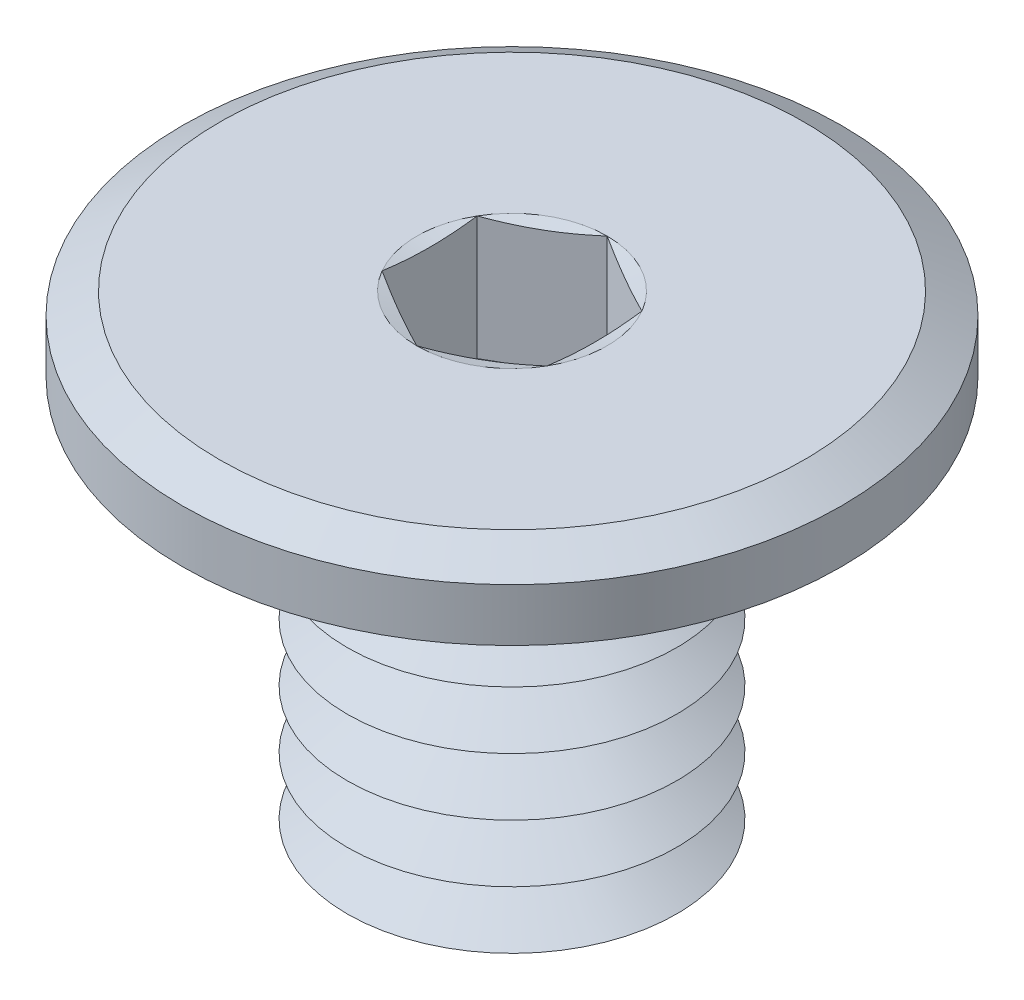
ISO-10303-21;
HEADER;
FILE_DESCRIPTION(('STEP AP214'),'2;1');
FILE_NAME('part.step','',(''),(''),'','','');
FILE_SCHEMA(('AUTOMOTIVE_DESIGN { 1 0 10303 214 1 1 1 1 }'));
ENDSEC;
DATA;
#1=APPLICATION_CONTEXT('core data for automotive mechanical design processes');
#2=APPLICATION_PROTOCOL_DEFINITION('international standard','automotive_design',2000,#1);
#3=PRODUCT_CONTEXT('',#1,'mechanical');
#4=PRODUCT('Part','Part','',(#3));
#5=PRODUCT_RELATED_PRODUCT_CATEGORY('part','',(#4));
#6=PRODUCT_DEFINITION_FORMATION('','',#4);
#7=PRODUCT_DEFINITION_CONTEXT('part definition',#1,'design');
#8=PRODUCT_DEFINITION('design','',#6,#7);
#9=PRODUCT_DEFINITION_SHAPE('','',#8);
#10=(LENGTH_UNIT() NAMED_UNIT(*) SI_UNIT(.MILLI.,.METRE.));
#11=(NAMED_UNIT(*) PLANE_ANGLE_UNIT() SI_UNIT($,.RADIAN.));
#12=(NAMED_UNIT(*) SI_UNIT($,.STERADIAN.) SOLID_ANGLE_UNIT());
#13=UNCERTAINTY_MEASURE_WITH_UNIT(LENGTH_MEASURE(1.E-05),#10,'distance_accuracy_value','');
#14=(GEOMETRIC_REPRESENTATION_CONTEXT(3) GLOBAL_UNCERTAINTY_ASSIGNED_CONTEXT((#13)) GLOBAL_UNIT_ASSIGNED_CONTEXT((#10,
#11,#12)) REPRESENTATION_CONTEXT('',''));
#15=CARTESIAN_POINT('',(0.,0.,0.));
#16=DIRECTION('',(0.,0.,1.));
#17=DIRECTION('',(1.,0.,0.));
#18=AXIS2_PLACEMENT_3D('',#15,#16,#17);
#19=CARTESIAN_POINT('',(0.,-4.85,0.));
#20=DIRECTION('',(0.,-1.,0.));
#21=DIRECTION('',(0.,0.,-1.));
#22=AXIS2_PLACEMENT_3D('',#19,#20,#21);
#23=CONICAL_SURFACE('',#22,2.,1.0471975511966);
#24=CARTESIAN_POINT('',(0.,-4.5,0.));
#25=DIRECTION('',(0.,1.,0.));
#26=DIRECTION('',(0.,0.,1.));
#27=AXIS2_PLACEMENT_3D('',#24,#25,#26);
#28=CIRCLE('',#27,1.39378221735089);
#29=CARTESIAN_POINT('',(0.,-4.5,1.39378221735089));
#30=VERTEX_POINT('',#29);
#31=EDGE_CURVE('E401',#30,#30,#28,.T.);
#32=ORIENTED_EDGE('',*,*,#31,.F.);
#33=EDGE_LOOP('',(#32));
#34=FACE_BOUND('',#33,.T.);
#35=CARTESIAN_POINT('',(0.,-4.85,0.));
#36=DIRECTION('',(0.,1.,0.));
#37=DIRECTION('',(0.,0.,1.));
#38=AXIS2_PLACEMENT_3D('',#35,#36,#37);
#39=CIRCLE('',#38,2.);
#40=CARTESIAN_POINT('',(0.,-4.85,2.));
#41=VERTEX_POINT('',#40);
#42=EDGE_CURVE('E405',#41,#41,#39,.T.);
#43=ORIENTED_EDGE('',*,*,#42,.T.);
#44=EDGE_LOOP('',(#43));
#45=FACE_BOUND('',#44,.T.);
#46=ADVANCED_FACE('F39',(#34,#45),#23,.T.);
#47=CARTESIAN_POINT('',(0.,-4.5,0.));
#48=DIRECTION('',(0.,1.,0.));
#49=DIRECTION('',(0.,0.,1.));
#50=AXIS2_PLACEMENT_3D('',#47,#48,#49);
#51=CONICAL_SURFACE('',#50,1.39378221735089,1.0471975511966);
#52=CARTESIAN_POINT('',(0.,-4.15,0.));
#53=DIRECTION('',(0.,1.,0.));
#54=DIRECTION('',(0.,0.,1.));
#55=AXIS2_PLACEMENT_3D('',#52,#53,#54);
#56=CIRCLE('',#55,2.);
#57=CARTESIAN_POINT('',(0.,-4.15,2.));
#58=VERTEX_POINT('',#57);
#59=EDGE_CURVE('E398',#58,#58,#56,.T.);
#60=ORIENTED_EDGE('',*,*,#59,.F.);
#61=EDGE_LOOP('',(#60));
#62=FACE_BOUND('',#61,.T.);
#63=ORIENTED_EDGE('',*,*,#31,.T.);
#64=EDGE_LOOP('',(#63));
#65=FACE_BOUND('',#64,.T.);
#66=ADVANCED_FACE('F233',(#62,#65),#51,.T.);
#67=CARTESIAN_POINT('',(0.,-5.9,0.));
#68=DIRECTION('',(0.,-1.,0.));
#69=DIRECTION('',(0.,0.,-1.));
#70=AXIS2_PLACEMENT_3D('',#67,#68,#69);
#71=PLANE('',#70);
#72=CARTESIAN_POINT('',(0.,-5.9,0.));
#73=DIRECTION('',(0.,1.,0.));
#74=DIRECTION('',(0.,0.,1.));
#75=AXIS2_PLACEMENT_3D('',#72,#73,#74);
#76=CIRCLE('',#75,1.39378221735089);
#77=CARTESIAN_POINT('',(0.,-5.9,1.39378221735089));
#78=VERTEX_POINT('',#77);
#79=EDGE_CURVE('E298',#78,#78,#76,.T.);
#80=ORIENTED_EDGE('',*,*,#79,.F.);
#81=EDGE_LOOP('',(#80));
#82=FACE_BOUND('',#81,.T.);
#83=ADVANCED_FACE('F239',(#82),#71,.T.);
#84=CARTESIAN_POINT('',(0.,-5.9,0.));
#85=DIRECTION('',(0.,1.,0.));
#86=DIRECTION('',(0.,0.,1.));
#87=AXIS2_PLACEMENT_3D('',#84,#85,#86);
#88=CONICAL_SURFACE('',#87,1.39378221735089,1.0471975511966);
#89=CARTESIAN_POINT('',(0.,-5.55,0.));
#90=DIRECTION('',(0.,1.,0.));
#91=DIRECTION('',(0.,0.,1.));
#92=AXIS2_PLACEMENT_3D('',#89,#90,#91);
#93=CIRCLE('',#92,2.);
#94=CARTESIAN_POINT('',(0.,-5.55,2.));
#95=VERTEX_POINT('',#94);
#96=EDGE_CURVE('E412',#95,#95,#93,.T.);
#97=ORIENTED_EDGE('',*,*,#96,.F.);
#98=EDGE_LOOP('',(#97));
#99=FACE_BOUND('',#98,.T.);
#100=ORIENTED_EDGE('',*,*,#79,.T.);
#101=EDGE_LOOP('',(#100));
#102=FACE_BOUND('',#101,.T.);
#103=ADVANCED_FACE('F254',(#99,#102),#88,.T.);
#104=CARTESIAN_POINT('',(0.,-5.55,0.));
#105=DIRECTION('',(0.,-1.,0.));
#106=DIRECTION('',(0.,0.,-1.));
#107=AXIS2_PLACEMENT_3D('',#104,#105,#106);
#108=CONICAL_SURFACE('',#107,2.,1.0471975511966);
#109=CARTESIAN_POINT('',(0.,-5.2,0.));
#110=DIRECTION('',(0.,1.,0.));
#111=DIRECTION('',(0.,0.,1.));
#112=AXIS2_PLACEMENT_3D('',#109,#110,#111);
#113=CIRCLE('',#112,1.39378221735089);
#114=CARTESIAN_POINT('',(0.,-5.2,1.39378221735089));
#115=VERTEX_POINT('',#114);
#116=EDGE_CURVE('E408',#115,#115,#113,.T.);
#117=ORIENTED_EDGE('',*,*,#116,.F.);
#118=EDGE_LOOP('',(#117));
#119=FACE_BOUND('',#118,.T.);
#120=ORIENTED_EDGE('',*,*,#96,.T.);
#121=EDGE_LOOP('',(#120));
#122=FACE_BOUND('',#121,.T.);
#123=ADVANCED_FACE('F250',(#119,#122),#108,.T.);
#124=CARTESIAN_POINT('',(0.,-5.2,0.));
#125=DIRECTION('',(0.,1.,0.));
#126=DIRECTION('',(0.,0.,1.));
#127=AXIS2_PLACEMENT_3D('',#124,#125,#126);
#128=CONICAL_SURFACE('',#127,1.39378221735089,1.0471975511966);
#129=ORIENTED_EDGE('',*,*,#42,.F.);
#130=EDGE_LOOP('',(#129));
#131=FACE_BOUND('',#130,.T.);
#132=ORIENTED_EDGE('',*,*,#116,.T.);
#133=EDGE_LOOP('',(#132));
#134=FACE_BOUND('',#133,.T.);
#135=ADVANCED_FACE('F246',(#131,#134),#128,.T.);
#136=CARTESIAN_POINT('',(0.,-4.15,0.));
#137=DIRECTION('',(0.,-1.,0.));
#138=DIRECTION('',(0.,0.,-1.));
#139=AXIS2_PLACEMENT_3D('',#136,#137,#138);
#140=CONICAL_SURFACE('',#139,2.,1.0471975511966);
#141=CARTESIAN_POINT('',(0.,-3.8,0.));
#142=DIRECTION('',(0.,1.,0.));
#143=DIRECTION('',(0.,0.,1.));
#144=AXIS2_PLACEMENT_3D('',#141,#142,#143);
#145=CIRCLE('',#144,1.39378221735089);
#146=CARTESIAN_POINT('',(0.,-3.8,1.39378221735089));
#147=VERTEX_POINT('',#146);
#148=EDGE_CURVE('E394',#147,#147,#145,.T.);
#149=ORIENTED_EDGE('',*,*,#148,.F.);
#150=EDGE_LOOP('',(#149));
#151=FACE_BOUND('',#150,.T.);
#152=ORIENTED_EDGE('',*,*,#59,.T.);
#153=EDGE_LOOP('',(#152));
#154=FACE_BOUND('',#153,.T.);
#155=ADVANCED_FACE('F249',(#151,#154),#140,.T.);
#156=CARTESIAN_POINT('',(0.,-3.8,0.));
#157=DIRECTION('',(0.,1.,0.));
#158=DIRECTION('',(0.,0.,1.));
#159=AXIS2_PLACEMENT_3D('',#156,#157,#158);
#160=CONICAL_SURFACE('',#159,1.39378221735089,1.0471975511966);
#161=CARTESIAN_POINT('',(0.,-3.45,0.));
#162=DIRECTION('',(0.,1.,0.));
#163=DIRECTION('',(0.,0.,1.));
#164=AXIS2_PLACEMENT_3D('',#161,#162,#163);
#165=CIRCLE('',#164,2.);
#166=CARTESIAN_POINT('',(0.,-3.45,2.));
#167=VERTEX_POINT('',#166);
#168=EDGE_CURVE('E390',#167,#167,#165,.T.);
#169=ORIENTED_EDGE('',*,*,#168,.F.);
#170=EDGE_LOOP('',(#169));
#171=FACE_BOUND('',#170,.T.);
#172=ORIENTED_EDGE('',*,*,#148,.T.);
#173=EDGE_LOOP('',(#172));
#174=FACE_BOUND('',#173,.T.);
#175=ADVANCED_FACE('F558',(#171,#174),#160,.T.);
#176=CARTESIAN_POINT('',(0.,-3.45,0.));
#177=DIRECTION('',(0.,-1.,0.));
#178=DIRECTION('',(0.,0.,-1.));
#179=AXIS2_PLACEMENT_3D('',#176,#177,#178);
#180=CONICAL_SURFACE('',#179,2.,1.0471975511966);
#181=CARTESIAN_POINT('',(0.,-3.1,0.));
#182=DIRECTION('',(0.,1.,0.));
#183=DIRECTION('',(0.,0.,1.));
#184=AXIS2_PLACEMENT_3D('',#181,#182,#183);
#185=CIRCLE('',#184,1.39378221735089);
#186=CARTESIAN_POINT('',(0.,-3.1,1.39378221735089));
#187=VERTEX_POINT('',#186);
#188=EDGE_CURVE('E387',#187,#187,#185,.T.);
#189=ORIENTED_EDGE('',*,*,#188,.F.);
#190=EDGE_LOOP('',(#189));
#191=FACE_BOUND('',#190,.T.);
#192=ORIENTED_EDGE('',*,*,#168,.T.);
#193=EDGE_LOOP('',(#192));
#194=FACE_BOUND('',#193,.T.);
#195=ADVANCED_FACE('F549',(#191,#194),#180,.T.);
#196=CARTESIAN_POINT('',(0.,-3.1,0.));
#197=DIRECTION('',(0.,1.,0.));
#198=DIRECTION('',(0.,0.,1.));
#199=AXIS2_PLACEMENT_3D('',#196,#197,#198);
#200=CONICAL_SURFACE('',#199,1.39378221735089,1.0471975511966);
#201=CARTESIAN_POINT('',(0.,-2.75,0.));
#202=DIRECTION('',(0.,1.,0.));
#203=DIRECTION('',(0.,0.,1.));
#204=AXIS2_PLACEMENT_3D('',#201,#202,#203);
#205=CIRCLE('',#204,2.);
#206=CARTESIAN_POINT('',(0.,-2.75,2.));
#207=VERTEX_POINT('',#206);
#208=EDGE_CURVE('E384',#207,#207,#205,.T.);
#209=ORIENTED_EDGE('',*,*,#208,.F.);
#210=EDGE_LOOP('',(#209));
#211=FACE_BOUND('',#210,.T.);
#212=ORIENTED_EDGE('',*,*,#188,.T.);
#213=EDGE_LOOP('',(#212));
#214=FACE_BOUND('',#213,.T.);
#215=ADVANCED_FACE('F540',(#211,#214),#200,.T.);
#216=CARTESIAN_POINT('',(0.,-2.75,0.));
#217=DIRECTION('',(0.,-1.,0.));
#218=DIRECTION('',(0.,0.,-1.));
#219=AXIS2_PLACEMENT_3D('',#216,#217,#218);
#220=CONICAL_SURFACE('',#219,2.,1.0471975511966);
#221=CARTESIAN_POINT('',(0.,-2.4,0.));
#222=DIRECTION('',(0.,1.,0.));
#223=DIRECTION('',(0.,0.,1.));
#224=AXIS2_PLACEMENT_3D('',#221,#222,#223);
#225=CIRCLE('',#224,1.39378221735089);
#226=CARTESIAN_POINT('',(0.,-2.4,1.39378221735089));
#227=VERTEX_POINT('',#226);
#228=EDGE_CURVE('E380',#227,#227,#225,.T.);
#229=ORIENTED_EDGE('',*,*,#228,.F.);
#230=EDGE_LOOP('',(#229));
#231=FACE_BOUND('',#230,.T.);
#232=ORIENTED_EDGE('',*,*,#208,.T.);
#233=EDGE_LOOP('',(#232));
#234=FACE_BOUND('',#233,.T.);
#235=ADVANCED_FACE('F531',(#231,#234),#220,.T.);
#236=CARTESIAN_POINT('',(0.,-2.4,0.));
#237=DIRECTION('',(0.,1.,0.));
#238=DIRECTION('',(0.,0.,1.));
#239=AXIS2_PLACEMENT_3D('',#236,#237,#238);
#240=CONICAL_SURFACE('',#239,1.39378221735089,1.0471975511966);
#241=CARTESIAN_POINT('',(0.,-2.05,0.));
#242=DIRECTION('',(0.,1.,0.));
#243=DIRECTION('',(0.,0.,1.));
#244=AXIS2_PLACEMENT_3D('',#241,#242,#243);
#245=CIRCLE('',#244,2.);
#246=CARTESIAN_POINT('',(0.,-2.05,2.));
#247=VERTEX_POINT('',#246);
#248=EDGE_CURVE('E365',#247,#247,#245,.T.);
#249=ORIENTED_EDGE('',*,*,#248,.F.);
#250=EDGE_LOOP('',(#249));
#251=FACE_BOUND('',#250,.T.);
#252=ORIENTED_EDGE('',*,*,#228,.T.);
#253=EDGE_LOOP('',(#252));
#254=FACE_BOUND('',#253,.T.);
#255=ADVANCED_FACE('F274',(#251,#254),#240,.T.);
#256=CARTESIAN_POINT('',(0.,0.,0.));
#257=DIRECTION('',(0.,1.,0.));
#258=DIRECTION('',(0.,0.,1.));
#259=AXIS2_PLACEMENT_3D('',#256,#257,#258);
#260=PLANE('',#259);
#261=CARTESIAN_POINT('',(0.,0.,0.));
#262=DIRECTION('',(0.,1.,0.));
#263=DIRECTION('',(0.,0.,1.));
#264=AXIS2_PLACEMENT_3D('',#261,#262,#263);
#265=CIRCLE('',#264,1.15470053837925);
#266=CARTESIAN_POINT('',(0.,0.,1.15470053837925));
#267=VERTEX_POINT('',#266);
#268=CARTESIAN_POINT('',(0.999999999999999,0.,0.577350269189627));
#269=VERTEX_POINT('',#268);
#270=EDGE_CURVE('E66',#267,#269,#265,.T.);
#271=ORIENTED_EDGE('',*,*,#270,.F.);
#272=CARTESIAN_POINT('',(-1.,0.,0.577350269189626));
#273=VERTEX_POINT('',#272);
#274=EDGE_CURVE('E169',#273,#267,#265,.T.);
#275=ORIENTED_EDGE('',*,*,#274,.F.);
#276=CARTESIAN_POINT('',(-1.,0.,-0.577350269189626));
#277=VERTEX_POINT('',#276);
#278=EDGE_CURVE('E164',#277,#273,#265,.T.);
#279=ORIENTED_EDGE('',*,*,#278,.F.);
#280=CARTESIAN_POINT('',(0.,0.,-1.15470053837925));
#281=VERTEX_POINT('',#280);
#282=EDGE_CURVE('E128',#281,#277,#265,.T.);
#283=ORIENTED_EDGE('',*,*,#282,.F.);
#284=CARTESIAN_POINT('',(1.,0.,-0.577350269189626));
#285=VERTEX_POINT('',#284);
#286=EDGE_CURVE('E119',#285,#281,#265,.T.);
#287=ORIENTED_EDGE('',*,*,#286,.F.);
#288=EDGE_CURVE('E59',#269,#285,#265,.T.);
#289=ORIENTED_EDGE('',*,*,#288,.F.);
#290=EDGE_LOOP('',(#271,#275,#279,#283,#287,#289));
#291=FACE_BOUND('',#290,.T.);
#292=CARTESIAN_POINT('',(0.,0.,0.));
#293=DIRECTION('',(0.,1.,0.));
#294=DIRECTION('',(0.,0.,1.));
#295=AXIS2_PLACEMENT_3D('',#292,#293,#294);
#296=CIRCLE('',#295,3.55);
#297=CARTESIAN_POINT('',(0.,0.,3.55));
#298=VERTEX_POINT('',#297);
#299=EDGE_CURVE('E294',#298,#298,#296,.T.);
#300=ORIENTED_EDGE('',*,*,#299,.T.);
#301=EDGE_LOOP('',(#300));
#302=FACE_BOUND('',#301,.T.);
#303=ADVANCED_FACE('F160',(#291,#302),#260,.T.);
#304=CARTESIAN_POINT('',(0.,-0.9,0.));
#305=DIRECTION('',(0.,1.,0.));
#306=DIRECTION('',(0.,0.,1.));
#307=AXIS2_PLACEMENT_3D('',#304,#305,#306);
#308=CYLINDRICAL_SURFACE('',#307,4.);
#309=CARTESIAN_POINT('',(0.,-0.259807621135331,0.));
#310=DIRECTION('',(0.,1.,0.));
#311=DIRECTION('',(0.,0.,1.));
#312=AXIS2_PLACEMENT_3D('',#309,#310,#311);
#313=CIRCLE('',#312,4.);
#314=CARTESIAN_POINT('',(0.,-0.259807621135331,4.));
#315=VERTEX_POINT('',#314);
#316=EDGE_CURVE('E305',#315,#315,#313,.F.);
#317=ORIENTED_EDGE('',*,*,#316,.T.);
#318=EDGE_LOOP('',(#317));
#319=FACE_BOUND('',#318,.T.);
#320=CARTESIAN_POINT('',(0.,-0.9,0.));
#321=DIRECTION('',(0.,1.,0.));
#322=DIRECTION('',(0.,0.,1.));
#323=AXIS2_PLACEMENT_3D('',#320,#321,#322);
#324=CIRCLE('',#323,4.);
#325=CARTESIAN_POINT('',(0.,-0.9,4.));
#326=VERTEX_POINT('',#325);
#327=EDGE_CURVE('E290',#326,#326,#324,.T.);
#328=ORIENTED_EDGE('',*,*,#327,.T.);
#329=EDGE_LOOP('',(#328));
#330=FACE_BOUND('',#329,.T.);
#331=ADVANCED_FACE('F270',(#319,#330),#308,.T.);
#332=CARTESIAN_POINT('',(0.,-0.9,0.));
#333=DIRECTION('',(0.,1.,0.));
#334=DIRECTION('',(0.,0.,1.));
#335=AXIS2_PLACEMENT_3D('',#332,#333,#334);
#336=PLANE('',#335);
#337=CARTESIAN_POINT('',(0.,-0.9,0.));
#338=DIRECTION('',(0.,1.,0.));
#339=DIRECTION('',(0.,0.,1.));
#340=AXIS2_PLACEMENT_3D('',#337,#338,#339);
#341=CIRCLE('',#340,2.2);
#342=CARTESIAN_POINT('',(0.,-0.9,2.2));
#343=VERTEX_POINT('',#342);
#344=EDGE_CURVE('E286',#343,#343,#341,.T.);
#345=ORIENTED_EDGE('',*,*,#344,.T.);
#346=EDGE_LOOP('',(#345));
#347=FACE_BOUND('',#346,.T.);
#348=ORIENTED_EDGE('',*,*,#327,.F.);
#349=EDGE_LOOP('',(#348));
#350=FACE_BOUND('',#349,.T.);
#351=ADVANCED_FACE('F266',(#347,#350),#336,.F.);
#352=CARTESIAN_POINT('',(0.,-5.9,0.));
#353=DIRECTION('',(0.,1.,0.));
#354=DIRECTION('',(0.,0.,1.));
#355=AXIS2_PLACEMENT_3D('',#352,#353,#354);
#356=CYLINDRICAL_SURFACE('',#355,2.);
#357=CARTESIAN_POINT('',(0.,-1.1,0.));
#358=DIRECTION('',(0.,1.,0.));
#359=DIRECTION('',(0.,0.,1.));
#360=AXIS2_PLACEMENT_3D('',#357,#358,#359);
#361=CIRCLE('',#360,2.);
#362=CARTESIAN_POINT('',(0.,-1.1,2.));
#363=VERTEX_POINT('',#362);
#364=EDGE_CURVE('E289',#363,#363,#361,.F.);
#365=ORIENTED_EDGE('',*,*,#364,.T.);
#366=EDGE_LOOP('',(#365));
#367=FACE_BOUND('',#366,.T.);
#368=ORIENTED_EDGE('',*,*,#248,.T.);
#369=EDGE_LOOP('',(#368));
#370=FACE_BOUND('',#369,.T.);
#371=ADVANCED_FACE('F262',(#367,#370),#356,.T.);
#372=CARTESIAN_POINT('',(0.,-1.1,0.));
#373=DIRECTION('',(0.,1.,0.));
#374=DIRECTION('',(0.,0.,1.));
#375=AXIS2_PLACEMENT_3D('',#372,#373,#374);
#376=TOROIDAL_SURFACE('',#375,2.2,0.2);
#377=ORIENTED_EDGE('',*,*,#344,.F.);
#378=EDGE_LOOP('',(#377));
#379=FACE_BOUND('',#378,.T.);
#380=ORIENTED_EDGE('',*,*,#364,.F.);
#381=EDGE_LOOP('',(#380));
#382=FACE_BOUND('',#381,.T.);
#383=ADVANCED_FACE('F265',(#379,#382),#376,.F.);
#384=CARTESIAN_POINT('',(0.,0.,0.));
#385=DIRECTION('',(0.,-1.,0.));
#386=DIRECTION('',(0.,0.,-1.));
#387=AXIS2_PLACEMENT_3D('',#384,#385,#386);
#388=CONICAL_SURFACE('',#387,3.55,1.0471975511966);
#389=ORIENTED_EDGE('',*,*,#316,.F.);
#390=EDGE_LOOP('',(#389));
#391=FACE_BOUND('',#390,.T.);
#392=ORIENTED_EDGE('',*,*,#299,.F.);
#393=EDGE_LOOP('',(#392));
#394=FACE_BOUND('',#393,.T.);
#395=ADVANCED_FACE('F41',(#391,#394),#388,.T.);
#396=CARTESIAN_POINT('',(0.,0.,0.));
#397=DIRECTION('',(0.,1.,0.));
#398=DIRECTION('',(0.,0.,1.));
#399=AXIS2_PLACEMENT_3D('',#396,#397,#398);
#400=CONICAL_SURFACE('',#399,1.15470053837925,1.30899693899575);
#401=ORIENTED_EDGE('',*,*,#282,.T.);
#402=CARTESIAN_POINT('',(0.00020000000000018,3.09447482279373E-05,-1.15481600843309));
#403=CARTESIAN_POINT('',(-0.0413440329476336,-0.00640029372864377,-1.13083054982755));
#404=CARTESIAN_POINT('',(-0.0829634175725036,-0.0122389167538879,-1.10680158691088));
#405=CARTESIAN_POINT('',(-0.166349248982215,-0.0224969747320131,-1.05865875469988));
#406=CARTESIAN_POINT('',(-0.208115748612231,-0.0269158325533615,-1.03454485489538));
#407=CARTESIAN_POINT('',(-0.291542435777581,-0.0340762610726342,-0.986378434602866));
#408=CARTESIAN_POINT('',(-0.333202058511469,-0.0368263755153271,-0.962326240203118));
#409=CARTESIAN_POINT('',(-0.416574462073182,-0.0405140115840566,-0.914191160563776));
#410=CARTESIAN_POINT('',(-0.458287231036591,-0.0414518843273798,-0.890108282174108));
#411=CARTESIAN_POINT('',(-0.541712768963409,-0.0414518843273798,-0.84194252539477));
#412=CARTESIAN_POINT('',(-0.583425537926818,-0.0405140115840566,-0.817859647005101));
#413=CARTESIAN_POINT('',(-0.666797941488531,-0.0368263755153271,-0.76972456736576));
#414=CARTESIAN_POINT('',(-0.708457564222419,-0.0340762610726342,-0.745672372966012));
#415=CARTESIAN_POINT('',(-0.791884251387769,-0.0269158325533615,-0.697505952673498));
#416=CARTESIAN_POINT('',(-0.833650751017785,-0.0224969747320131,-0.673392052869));
#417=CARTESIAN_POINT('',(-0.917036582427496,-0.0122389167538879,-0.625249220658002));
#418=CARTESIAN_POINT('',(-0.958655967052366,-0.00640029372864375,-0.601220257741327));
#419=CARTESIAN_POINT('',(-1.0002,3.09447482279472E-05,-0.577234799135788));
#420=B_SPLINE_CURVE_WITH_KNOTS('',3,(#402,#403,#404,#405,#406,#407,#408,#409,#410,#411,#412,
#413,#414,#415,#416,#417,#418,#419),.UNSPECIFIED.,.F.,.F.,(4,2,2,2,2,2,2,2,4),(0.,
0.145207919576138,0.290474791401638,0.434991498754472,0.579480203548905,0.723968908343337,
0.868485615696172,1.01375248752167,1.15896040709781),.UNSPECIFIED.);
#421=EDGE_CURVE('E11',#281,#277,#420,.T.);
#422=ORIENTED_EDGE('',*,*,#421,.F.);
#423=EDGE_LOOP('',(#401,#422));
#424=FACE_BOUND('',#423,.T.);
#425=ADVANCED_FACE('F132',(#424),#400,.F.);
#426=ORIENTED_EDGE('',*,*,#278,.T.);
#427=CARTESIAN_POINT('',(-1.,0.236023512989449,-1.77298423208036));
#428=CARTESIAN_POINT('',(-1.,0.216107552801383,-1.6875314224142));
#429=CARTESIAN_POINT('',(-1.,0.196471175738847,-1.60200905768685));
#430=CARTESIAN_POINT('',(-1.,0.158144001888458,-1.43073686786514));
#431=CARTESIAN_POINT('',(-1.,0.139453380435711,-1.34498700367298));
#432=CARTESIAN_POINT('',(-1.,0.1032364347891,-1.17236724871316));
#433=CARTESIAN_POINT('',(-1.,0.0857232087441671,-1.08549457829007));
#434=CARTESIAN_POINT('',(-1.,0.0527507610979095,-0.911344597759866));
#435=CARTESIAN_POINT('',(-1.,0.0372917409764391,-0.824067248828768));
#436=CARTESIAN_POINT('',(-1.,0.00985747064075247,-0.651412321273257));
#437=CARTESIAN_POINT('',(-1.,-0.00220187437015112,-0.566048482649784));
#438=CARTESIAN_POINT('',(-1.,-0.0220616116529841,-0.394830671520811));
#439=CARTESIAN_POINT('',(-1.,-0.0298633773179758,-0.308976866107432));
#440=CARTESIAN_POINT('',(-1.,-0.0398601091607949,-0.137316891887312));
#441=CARTESIAN_POINT('',(-1.,-0.0420806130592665,-0.0515123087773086));
#442=CARTESIAN_POINT('',(-1.,-0.0405086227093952,0.120045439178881));
#443=CARTESIAN_POINT('',(-1.,-0.0367157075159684,0.20579860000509));
#444=CARTESIAN_POINT('',(-1.,-0.0256781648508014,0.353235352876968));
#445=CARTESIAN_POINT('',(-1.,-0.0196775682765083,0.415019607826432));
#446=CARTESIAN_POINT('',(-1.,-0.00545724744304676,0.538326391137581));
#447=CARTESIAN_POINT('',(-1.,0.00276242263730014,0.599848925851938));
#448=CARTESIAN_POINT('',(-1.,0.0300253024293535,0.784439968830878));
#449=CARTESIAN_POINT('',(-1.,0.051635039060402,0.907124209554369));
#450=CARTESIAN_POINT('',(-1.,0.0871575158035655,1.09186138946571));
#451=CARTESIAN_POINT('',(-1.,0.0996614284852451,1.15420316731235));
#452=CARTESIAN_POINT('',(-1.,0.125434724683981,1.27873123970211));
#453=CARTESIAN_POINT('',(-1.,0.138704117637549,1.34091753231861));
#454=CARTESIAN_POINT('',(-1.,0.165737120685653,1.4648085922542));
#455=CARTESIAN_POINT('',(-1.,0.179497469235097,1.5265140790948));
#456=CARTESIAN_POINT('',(-1.,0.207459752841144,1.64982040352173));
#457=CARTESIAN_POINT('',(-1.,0.221661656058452,1.71142124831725));
#458=CARTESIAN_POINT('',(-1.,0.236023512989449,1.77298423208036));
#459=B_SPLINE_CURVE_WITH_KNOTS('',3,(#427,#428,#429,#430,#431,#432,#433,#434,#435,#436,#437,
#438,#439,#440,#441,#442,#443,#444,#445,#446,#447,#448,#449,#450,#451,#452,#453,#454,#455,#456,
#457,#458),.UNSPECIFIED.,.F.,.F.,(4,2,2,2,2,2,2,2,2,2,2,2,2,2,2,4),(0.,0.263234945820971,
0.52651851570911,0.792363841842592,1.0582352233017,1.31679695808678,1.5752752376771,
1.83256864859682,2.08988007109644,2.27606085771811,2.462237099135,2.83581575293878,
3.02656672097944,3.21732004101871,3.40698211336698,3.59663054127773),.UNSPECIFIED.);
#460=EDGE_CURVE('E172',#277,#273,#459,.T.);
#461=ORIENTED_EDGE('',*,*,#460,.F.);
#462=EDGE_LOOP('',(#426,#461));
#463=FACE_BOUND('',#462,.T.);
#464=ADVANCED_FACE('F452',(#463),#400,.F.);
#465=ORIENTED_EDGE('',*,*,#274,.T.);
#466=CARTESIAN_POINT('',(-1.0002,3.09447482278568E-05,0.577234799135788));
#467=CARTESIAN_POINT('',(-0.958655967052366,-0.0064002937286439,0.601220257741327));
#468=CARTESIAN_POINT('',(-0.917036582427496,-0.0122389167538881,0.625249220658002));
#469=CARTESIAN_POINT('',(-0.833650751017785,-0.0224969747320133,0.673392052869));
#470=CARTESIAN_POINT('',(-0.791884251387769,-0.0269158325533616,0.697505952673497));
#471=CARTESIAN_POINT('',(-0.708457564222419,-0.0340762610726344,0.745672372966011));
#472=CARTESIAN_POINT('',(-0.666797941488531,-0.0368263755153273,0.76972456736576));
#473=CARTESIAN_POINT('',(-0.583425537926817,-0.0405140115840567,0.817859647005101));
#474=CARTESIAN_POINT('',(-0.541712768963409,-0.0414518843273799,0.84194252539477));
#475=CARTESIAN_POINT('',(-0.458287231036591,-0.0414518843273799,0.890108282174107));
#476=CARTESIAN_POINT('',(-0.416574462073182,-0.0405140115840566,0.914191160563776));
#477=CARTESIAN_POINT('',(-0.333202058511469,-0.0368263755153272,0.962326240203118));
#478=CARTESIAN_POINT('',(-0.291542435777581,-0.0340762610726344,0.986378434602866));
#479=CARTESIAN_POINT('',(-0.20811574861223,-0.0269158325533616,1.03454485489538));
#480=CARTESIAN_POINT('',(-0.166349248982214,-0.0224969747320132,1.05865875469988));
#481=CARTESIAN_POINT('',(-0.0829634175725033,-0.0122389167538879,1.10680158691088));
#482=CARTESIAN_POINT('',(-0.0413440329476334,-0.00640029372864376,1.13083054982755));
#483=CARTESIAN_POINT('',(0.0002000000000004,3.09447482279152E-05,1.15481600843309));
#484=B_SPLINE_CURVE_WITH_KNOTS('',3,(#466,#467,#468,#469,#470,#471,#472,#473,#474,#475,#476,
#477,#478,#479,#480,#481,#482,#483),.UNSPECIFIED.,.F.,.F.,(4,2,2,2,2,2,2,2,4),(0.,
0.145207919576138,0.290474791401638,0.434991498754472,0.579480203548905,0.723968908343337,
0.868485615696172,1.01375248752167,1.15896040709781),.UNSPECIFIED.);
#485=EDGE_CURVE('E180',#273,#267,#484,.T.);
#486=ORIENTED_EDGE('',*,*,#485,.F.);
#487=EDGE_LOOP('',(#465,#486));
#488=FACE_BOUND('',#487,.T.);
#489=ADVANCED_FACE('F445',(#488),#400,.F.);
#490=ORIENTED_EDGE('',*,*,#270,.T.);
#491=CARTESIAN_POINT('',(-0.0001999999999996,3.09447482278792E-05,1.15481600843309));
#492=CARTESIAN_POINT('',(0.0413440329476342,-0.00640029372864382,1.13083054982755));
#493=CARTESIAN_POINT('',(0.0829634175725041,-0.012238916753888,1.10680158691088));
#494=CARTESIAN_POINT('',(0.166349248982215,-0.0224969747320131,1.05865875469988));
#495=CARTESIAN_POINT('',(0.208115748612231,-0.0269158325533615,1.03454485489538));
#496=CARTESIAN_POINT('',(0.291542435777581,-0.0340762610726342,0.986378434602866));
#497=CARTESIAN_POINT('',(0.333202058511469,-0.0368263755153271,0.962326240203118));
#498=CARTESIAN_POINT('',(0.416574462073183,-0.0405140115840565,0.914191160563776));
#499=CARTESIAN_POINT('',(0.458287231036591,-0.0414518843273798,0.890108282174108));
#500=CARTESIAN_POINT('',(0.541712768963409,-0.0414518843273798,0.84194252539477));
#501=CARTESIAN_POINT('',(0.583425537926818,-0.0405140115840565,0.817859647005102));
#502=CARTESIAN_POINT('',(0.666797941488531,-0.0368263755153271,0.76972456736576));
#503=CARTESIAN_POINT('',(0.708457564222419,-0.0340762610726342,0.745672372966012));
#504=CARTESIAN_POINT('',(0.791884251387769,-0.0269158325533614,0.697505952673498));
#505=CARTESIAN_POINT('',(0.833650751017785,-0.0224969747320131,0.673392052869));
#506=CARTESIAN_POINT('',(0.917036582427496,-0.0122389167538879,0.625249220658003));
#507=CARTESIAN_POINT('',(0.958655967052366,-0.00640029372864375,0.601220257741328));
#508=CARTESIAN_POINT('',(1.0002,3.09447482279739E-05,0.577234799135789));
#509=B_SPLINE_CURVE_WITH_KNOTS('',3,(#491,#492,#493,#494,#495,#496,#497,#498,#499,#500,#501,
#502,#503,#504,#505,#506,#507,#508),.UNSPECIFIED.,.F.,.F.,(4,2,2,2,2,2,2,2,4),(0.,
0.145207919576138,0.290474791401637,0.434991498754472,0.579480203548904,0.723968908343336,
0.868485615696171,1.01375248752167,1.15896040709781),.UNSPECIFIED.);
#510=EDGE_CURVE('E199',#267,#269,#509,.T.);
#511=ORIENTED_EDGE('',*,*,#510,.F.);
#512=EDGE_LOOP('',(#490,#511));
#513=FACE_BOUND('',#512,.T.);
#514=ADVANCED_FACE('F446',(#513),#400,.F.);
#515=ORIENTED_EDGE('',*,*,#288,.T.);
#516=CARTESIAN_POINT('',(1.,0.23602351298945,1.77298423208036));
#517=CARTESIAN_POINT('',(1.,0.216107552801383,1.6875314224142));
#518=CARTESIAN_POINT('',(1.,0.196471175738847,1.60200905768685));
#519=CARTESIAN_POINT('',(1.,0.158144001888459,1.43073686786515));
#520=CARTESIAN_POINT('',(1.,0.139453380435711,1.34498700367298));
#521=CARTESIAN_POINT('',(1.,0.1032364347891,1.17236724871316));
#522=CARTESIAN_POINT('',(1.,0.0857232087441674,1.08549457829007));
#523=CARTESIAN_POINT('',(1.,0.0527507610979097,0.911344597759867));
#524=CARTESIAN_POINT('',(1.,0.0372917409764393,0.824067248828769));
#525=CARTESIAN_POINT('',(1.,0.00985747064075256,0.651412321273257));
#526=CARTESIAN_POINT('',(1.,-0.00220187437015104,0.566048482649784));
#527=CARTESIAN_POINT('',(1.,-0.0220616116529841,0.394830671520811));
#528=CARTESIAN_POINT('',(1.,-0.0298633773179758,0.308976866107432));
#529=CARTESIAN_POINT('',(1.,-0.0398601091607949,0.137316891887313));
#530=CARTESIAN_POINT('',(1.,-0.0420806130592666,0.0515123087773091));
#531=CARTESIAN_POINT('',(1.,-0.0405086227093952,-0.120045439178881));
#532=CARTESIAN_POINT('',(1.,-0.0367157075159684,-0.205798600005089));
#533=CARTESIAN_POINT('',(1.,-0.0256781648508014,-0.353235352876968));
#534=CARTESIAN_POINT('',(1.,-0.0196775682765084,-0.415019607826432));
#535=CARTESIAN_POINT('',(1.,-0.00545724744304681,-0.538326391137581));
#536=CARTESIAN_POINT('',(1.,0.00276242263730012,-0.599848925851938));
#537=CARTESIAN_POINT('',(1.,0.0300253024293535,-0.784439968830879));
#538=CARTESIAN_POINT('',(1.,0.051635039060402,-0.907124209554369));
#539=CARTESIAN_POINT('',(1.,0.0871575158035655,-1.09186138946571));
#540=CARTESIAN_POINT('',(1.,0.0996614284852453,-1.15420316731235));
#541=CARTESIAN_POINT('',(1.,0.125434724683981,-1.27873123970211));
#542=CARTESIAN_POINT('',(1.,0.138704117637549,-1.34091753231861));
#543=CARTESIAN_POINT('',(1.,0.165737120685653,-1.4648085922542));
#544=CARTESIAN_POINT('',(1.,0.179497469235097,-1.5265140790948));
#545=CARTESIAN_POINT('',(1.,0.207459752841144,-1.64982040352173));
#546=CARTESIAN_POINT('',(1.,0.221661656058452,-1.71142124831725));
#547=CARTESIAN_POINT('',(1.,0.236023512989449,-1.77298423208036));
#548=B_SPLINE_CURVE_WITH_KNOTS('',3,(#516,#517,#518,#519,#520,#521,#522,#523,#524,#525,#526,
#527,#528,#529,#530,#531,#532,#533,#534,#535,#536,#537,#538,#539,#540,#541,#542,#543,#544,#545,
#546,#547),.UNSPECIFIED.,.F.,.F.,(4,2,2,2,2,2,2,2,2,2,2,2,2,2,2,4),(0.,0.263234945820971,
0.526518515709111,0.792363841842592,1.0582352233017,1.31679695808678,1.5752752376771,
1.83256864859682,2.08988007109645,2.27606085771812,2.462237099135,2.83581575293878,
3.02656672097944,3.21732004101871,3.40698211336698,3.59663054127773),.UNSPECIFIED.);
#549=EDGE_CURVE('E149',#269,#285,#548,.T.);
#550=ORIENTED_EDGE('',*,*,#549,.F.);
#551=EDGE_LOOP('',(#515,#550));
#552=FACE_BOUND('',#551,.T.);
#553=ADVANCED_FACE('F192',(#552),#400,.F.);
#554=ORIENTED_EDGE('',*,*,#286,.T.);
#555=CARTESIAN_POINT('',(1.0002,3.09447482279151E-05,-0.577234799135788));
#556=CARTESIAN_POINT('',(0.958655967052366,-0.00640029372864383,-0.601220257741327));
#557=CARTESIAN_POINT('',(0.917036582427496,-0.012238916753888,-0.625249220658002));
#558=CARTESIAN_POINT('',(0.833650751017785,-0.0224969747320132,-0.673392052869));
#559=CARTESIAN_POINT('',(0.791884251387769,-0.0269158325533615,-0.697505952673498));
#560=CARTESIAN_POINT('',(0.708457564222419,-0.0340762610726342,-0.745672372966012));
#561=CARTESIAN_POINT('',(0.666797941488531,-0.0368263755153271,-0.76972456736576));
#562=CARTESIAN_POINT('',(0.583425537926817,-0.0405140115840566,-0.817859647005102));
#563=CARTESIAN_POINT('',(0.541712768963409,-0.0414518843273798,-0.84194252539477));
#564=CARTESIAN_POINT('',(0.458287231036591,-0.0414518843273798,-0.890108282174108));
#565=CARTESIAN_POINT('',(0.416574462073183,-0.0405140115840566,-0.914191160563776));
#566=CARTESIAN_POINT('',(0.333202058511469,-0.0368263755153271,-0.962326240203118));
#567=CARTESIAN_POINT('',(0.291542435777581,-0.0340762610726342,-0.986378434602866));
#568=CARTESIAN_POINT('',(0.208115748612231,-0.0269158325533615,-1.03454485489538));
#569=CARTESIAN_POINT('',(0.166349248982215,-0.0224969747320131,-1.05865875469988));
#570=CARTESIAN_POINT('',(0.082963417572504,-0.012238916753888,-1.10680158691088));
#571=CARTESIAN_POINT('',(0.0413440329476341,-0.00640029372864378,-1.13083054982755));
#572=CARTESIAN_POINT('',(-0.0001999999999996,3.09447482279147E-05,-1.15481600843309));
#573=B_SPLINE_CURVE_WITH_KNOTS('',3,(#555,#556,#557,#558,#559,#560,#561,#562,#563,#564,#565,
#566,#567,#568,#569,#570,#571,#572),.UNSPECIFIED.,.F.,.F.,(4,2,2,2,2,2,2,2,4),(0.,
0.145207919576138,0.290474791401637,0.434991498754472,0.579480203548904,0.723968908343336,
0.868485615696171,1.01375248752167,1.15896040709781),.UNSPECIFIED.);
#574=EDGE_CURVE('E123',#285,#281,#573,.T.);
#575=ORIENTED_EDGE('',*,*,#574,.F.);
#576=EDGE_LOOP('',(#554,#575));
#577=FACE_BOUND('',#576,.T.);
#578=ADVANCED_FACE('F121',(#577),#400,.F.);
#579=CARTESIAN_POINT('',(0.,-1.5,0.));
#580=DIRECTION('',(0.,1.,0.));
#581=DIRECTION('',(0.,0.,1.));
#582=AXIS2_PLACEMENT_3D('',#579,#580,#581);
#583=CONICAL_SURFACE('',#582,1.,1.0471975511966);
#584=CARTESIAN_POINT('',(0.,-2.07735026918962,0.));
#585=VERTEX_POINT('',#584);
#586=VERTEX_LOOP('',#585);
#587=FACE_BOUND('',#586,.T.);
#588=CARTESIAN_POINT('',(0.,-1.5,0.));
#589=DIRECTION('',(0.,1.,0.));
#590=DIRECTION('',(0.,0.,1.));
#591=AXIS2_PLACEMENT_3D('',#588,#589,#590);
#592=CIRCLE('',#591,1.);
#593=CARTESIAN_POINT('',(0.5,-1.5,0.866025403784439));
#594=VERTEX_POINT('',#593);
#595=CARTESIAN_POINT('',(1.,-1.5,0.));
#596=VERTEX_POINT('',#595);
#597=EDGE_CURVE('E148',#594,#596,#592,.T.);
#598=ORIENTED_EDGE('',*,*,#597,.T.);
#599=CARTESIAN_POINT('',(0.,-1.5,0.));
#600=DIRECTION('',(0.,1.,0.));
#601=DIRECTION('',(0.,0.,1.));
#602=AXIS2_PLACEMENT_3D('',#599,#600,#601);
#603=CIRCLE('',#602,1.);
#604=CARTESIAN_POINT('',(0.5,-1.5,-0.866025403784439));
#605=VERTEX_POINT('',#604);
#606=EDGE_CURVE('E53',#596,#605,#603,.T.);
#607=ORIENTED_EDGE('',*,*,#606,.T.);
#608=CARTESIAN_POINT('',(-0.5,-1.5,-0.866025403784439));
#609=VERTEX_POINT('',#608);
#610=EDGE_CURVE('E319',#605,#609,#603,.T.);
#611=ORIENTED_EDGE('',*,*,#610,.T.);
#612=CARTESIAN_POINT('',(-1.,-1.5,0.));
#613=VERTEX_POINT('',#612);
#614=EDGE_CURVE('E317',#609,#613,#603,.T.);
#615=ORIENTED_EDGE('',*,*,#614,.T.);
#616=CARTESIAN_POINT('',(-0.5,-1.5,0.866025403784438));
#617=VERTEX_POINT('',#616);
#618=EDGE_CURVE('E310',#613,#617,#603,.T.);
#619=ORIENTED_EDGE('',*,*,#618,.T.);
#620=EDGE_CURVE('E308',#617,#594,#603,.T.);
#621=ORIENTED_EDGE('',*,*,#620,.T.);
#622=EDGE_LOOP('',(#598,#607,#611,#615,#619,#621));
#623=FACE_BOUND('',#622,.T.);
#624=ADVANCED_FACE('F191',(#587,#623),#583,.F.);
#625=CARTESIAN_POINT('',(0.,-1.5,0.));
#626=DIRECTION('',(0.,1.,0.));
#627=DIRECTION('',(0.,0.,1.));
#628=AXIS2_PLACEMENT_3D('',#625,#626,#627);
#629=PLANE('',#628);
#630=ORIENTED_EDGE('',*,*,#606,.F.);
#631=DIRECTION('',(0.,0.,-1.));
#632=VECTOR('',#631,1.);
#633=CARTESIAN_POINT('',(1.,-1.5,0.577350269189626));
#634=LINE('',#633,#632);
#635=CARTESIAN_POINT('',(1.,-1.5,-0.577350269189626));
#636=VERTEX_POINT('',#635);
#637=EDGE_CURVE('E360',#596,#636,#634,.T.);
#638=ORIENTED_EDGE('',*,*,#637,.T.);
#639=DIRECTION('',(-0.866025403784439,0.,-0.5));
#640=VECTOR('',#639,1.);
#641=CARTESIAN_POINT('',(1.,-1.5,-0.577350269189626));
#642=LINE('',#641,#640);
#643=EDGE_CURVE('E420',#636,#605,#642,.T.);
#644=ORIENTED_EDGE('',*,*,#643,.T.);
#645=EDGE_LOOP('',(#630,#638,#644));
#646=FACE_BOUND('',#645,.T.);
#647=ADVANCED_FACE('F431',(#646),#629,.T.);
#648=ORIENTED_EDGE('',*,*,#597,.F.);
#649=DIRECTION('',(0.866025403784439,0.,-0.5));
#650=VECTOR('',#649,1.);
#651=CARTESIAN_POINT('',(0.,-1.5,1.15470053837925));
#652=LINE('',#651,#650);
#653=CARTESIAN_POINT('',(1.,-1.5,0.577350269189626));
#654=VERTEX_POINT('',#653);
#655=EDGE_CURVE('E356',#594,#654,#652,.T.);
#656=ORIENTED_EDGE('',*,*,#655,.T.);
#657=EDGE_CURVE('E157',#654,#596,#634,.T.);
#658=ORIENTED_EDGE('',*,*,#657,.T.);
#659=EDGE_LOOP('',(#648,#656,#658));
#660=FACE_BOUND('',#659,.T.);
#661=ADVANCED_FACE('F434',(#660),#629,.T.);
#662=ORIENTED_EDGE('',*,*,#620,.F.);
#663=DIRECTION('',(0.866025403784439,0.,0.5));
#664=VECTOR('',#663,1.);
#665=CARTESIAN_POINT('',(-1.,-1.5,0.577350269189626));
#666=LINE('',#665,#664);
#667=CARTESIAN_POINT('',(0.,-1.5,1.15470053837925));
#668=VERTEX_POINT('',#667);
#669=EDGE_CURVE('E348',#617,#668,#666,.T.);
#670=ORIENTED_EDGE('',*,*,#669,.T.);
#671=EDGE_CURVE('E357',#668,#594,#652,.T.);
#672=ORIENTED_EDGE('',*,*,#671,.T.);
#673=EDGE_LOOP('',(#662,#670,#672));
#674=FACE_BOUND('',#673,.T.);
#675=ADVANCED_FACE('F220',(#674),#629,.T.);
#676=ORIENTED_EDGE('',*,*,#618,.F.);
#677=DIRECTION('',(0.,0.,1.));
#678=VECTOR('',#677,1.);
#679=CARTESIAN_POINT('',(-1.,-1.5,-0.577350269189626));
#680=LINE('',#679,#678);
#681=CARTESIAN_POINT('',(-1.,-1.5,0.577350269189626));
#682=VERTEX_POINT('',#681);
#683=EDGE_CURVE('E337',#613,#682,#680,.T.);
#684=ORIENTED_EDGE('',*,*,#683,.T.);
#685=EDGE_CURVE('E340',#682,#617,#666,.T.);
#686=ORIENTED_EDGE('',*,*,#685,.T.);
#687=EDGE_LOOP('',(#676,#684,#686));
#688=FACE_BOUND('',#687,.T.);
#689=ADVANCED_FACE('F336',(#688),#629,.T.);
#690=ORIENTED_EDGE('',*,*,#610,.F.);
#691=CARTESIAN_POINT('',(0.,-1.5,-1.15470053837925));
#692=VERTEX_POINT('',#691);
#693=EDGE_CURVE('E424',#605,#692,#642,.T.);
#694=ORIENTED_EDGE('',*,*,#693,.T.);
#695=DIRECTION('',(-0.866025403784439,0.,0.5));
#696=VECTOR('',#695,1.);
#697=CARTESIAN_POINT('',(0.,-1.5,-1.15470053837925));
#698=LINE('',#697,#696);
#699=EDGE_CURVE('E154',#692,#609,#698,.T.);
#700=ORIENTED_EDGE('',*,*,#699,.T.);
#701=EDGE_LOOP('',(#690,#694,#700));
#702=FACE_BOUND('',#701,.T.);
#703=ADVANCED_FACE('F461',(#702),#629,.T.);
#704=ORIENTED_EDGE('',*,*,#614,.F.);
#705=CARTESIAN_POINT('',(-1.,-1.5,-0.577350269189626));
#706=VERTEX_POINT('',#705);
#707=EDGE_CURVE('E347',#609,#706,#698,.T.);
#708=ORIENTED_EDGE('',*,*,#707,.T.);
#709=EDGE_CURVE('E342',#706,#613,#680,.T.);
#710=ORIENTED_EDGE('',*,*,#709,.T.);
#711=EDGE_LOOP('',(#704,#708,#710));
#712=FACE_BOUND('',#711,.T.);
#713=ADVANCED_FACE('F346',(#712),#629,.T.);
#714=CARTESIAN_POINT('',(0.,-1.5,-1.15470053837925));
#715=DIRECTION('',(-0.5,0.,-0.866025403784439));
#716=DIRECTION('',(-0.866025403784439,0.,0.5));
#717=AXIS2_PLACEMENT_3D('',#714,#715,#716);
#718=PLANE('',#717);
#719=DIRECTION('',(0.,1.,0.));
#720=VECTOR('',#719,1.);
#721=CARTESIAN_POINT('',(0.,-1.5,-1.15470053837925));
#722=LINE('',#721,#720);
#723=EDGE_CURVE('E142',#692,#281,#722,.T.);
#724=ORIENTED_EDGE('',*,*,#723,.T.);
#725=ORIENTED_EDGE('',*,*,#421,.T.);
#726=DIRECTION('',(0.,1.,0.));
#727=VECTOR('',#726,1.);
#728=CARTESIAN_POINT('',(-1.,-1.5,-0.577350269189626));
#729=LINE('',#728,#727);
#730=EDGE_CURVE('E156',#706,#277,#729,.T.);
#731=ORIENTED_EDGE('',*,*,#730,.F.);
#732=ORIENTED_EDGE('',*,*,#707,.F.);
#733=ORIENTED_EDGE('',*,*,#699,.F.);
#734=EDGE_LOOP('',(#724,#725,#731,#732,#733));
#735=FACE_BOUND('',#734,.T.);
#736=ADVANCED_FACE('F151',(#735),#718,.F.);
#737=CARTESIAN_POINT('',(-1.,-1.5,-0.577350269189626));
#738=DIRECTION('',(-1.,0.,0.));
#739=DIRECTION('',(0.,0.,1.));
#740=AXIS2_PLACEMENT_3D('',#737,#738,#739);
#741=PLANE('',#740);
#742=ORIENTED_EDGE('',*,*,#730,.T.);
#743=ORIENTED_EDGE('',*,*,#460,.T.);
#744=DIRECTION('',(0.,1.,0.));
#745=VECTOR('',#744,1.);
#746=CARTESIAN_POINT('',(-1.,-1.5,0.577350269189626));
#747=LINE('',#746,#745);
#748=EDGE_CURVE('E343',#682,#273,#747,.T.);
#749=ORIENTED_EDGE('',*,*,#748,.F.);
#750=ORIENTED_EDGE('',*,*,#683,.F.);
#751=ORIENTED_EDGE('',*,*,#709,.F.);
#752=EDGE_LOOP('',(#742,#743,#749,#750,#751));
#753=FACE_BOUND('',#752,.T.);
#754=ADVANCED_FACE('F186',(#753),#741,.F.);
#755=CARTESIAN_POINT('',(-1.,-1.5,0.577350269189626));
#756=DIRECTION('',(-0.5,0.,0.866025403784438));
#757=DIRECTION('',(0.866025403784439,0.,0.5));
#758=AXIS2_PLACEMENT_3D('',#755,#756,#757);
#759=PLANE('',#758);
#760=ORIENTED_EDGE('',*,*,#748,.T.);
#761=ORIENTED_EDGE('',*,*,#485,.T.);
#762=DIRECTION('',(0.,1.,0.));
#763=VECTOR('',#762,1.);
#764=CARTESIAN_POINT('',(0.,-1.5,1.15470053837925));
#765=LINE('',#764,#763);
#766=EDGE_CURVE('E370',#668,#267,#765,.T.);
#767=ORIENTED_EDGE('',*,*,#766,.F.);
#768=ORIENTED_EDGE('',*,*,#669,.F.);
#769=ORIENTED_EDGE('',*,*,#685,.F.);
#770=EDGE_LOOP('',(#760,#761,#767,#768,#769));
#771=FACE_BOUND('',#770,.T.);
#772=ADVANCED_FACE('F223',(#771),#759,.F.);
#773=CARTESIAN_POINT('',(0.,-1.5,1.15470053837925));
#774=DIRECTION('',(0.5,0.,0.866025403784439));
#775=DIRECTION('',(0.866025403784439,0.,-0.5));
#776=AXIS2_PLACEMENT_3D('',#773,#774,#775);
#777=PLANE('',#776);
#778=ORIENTED_EDGE('',*,*,#766,.T.);
#779=ORIENTED_EDGE('',*,*,#510,.T.);
#780=DIRECTION('',(0.,1.,0.));
#781=VECTOR('',#780,1.);
#782=CARTESIAN_POINT('',(1.,-1.5,0.577350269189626));
#783=LINE('',#782,#781);
#784=EDGE_CURVE('E366',#654,#269,#783,.T.);
#785=ORIENTED_EDGE('',*,*,#784,.F.);
#786=ORIENTED_EDGE('',*,*,#655,.F.);
#787=ORIENTED_EDGE('',*,*,#671,.F.);
#788=EDGE_LOOP('',(#778,#779,#785,#786,#787));
#789=FACE_BOUND('',#788,.T.);
#790=ADVANCED_FACE('F218',(#789),#777,.F.);
#791=CARTESIAN_POINT('',(1.,-1.5,0.577350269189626));
#792=DIRECTION('',(1.,0.,0.));
#793=DIRECTION('',(0.,0.,-1.));
#794=AXIS2_PLACEMENT_3D('',#791,#792,#793);
#795=PLANE('',#794);
#796=ORIENTED_EDGE('',*,*,#784,.T.);
#797=ORIENTED_EDGE('',*,*,#549,.T.);
#798=DIRECTION('',(0.,1.,0.));
#799=VECTOR('',#798,1.);
#800=CARTESIAN_POINT('',(1.,-1.5,-0.577350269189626));
#801=LINE('',#800,#799);
#802=EDGE_CURVE('E146',#636,#285,#801,.T.);
#803=ORIENTED_EDGE('',*,*,#802,.F.);
#804=ORIENTED_EDGE('',*,*,#637,.F.);
#805=ORIENTED_EDGE('',*,*,#657,.F.);
#806=EDGE_LOOP('',(#796,#797,#803,#804,#805));
#807=FACE_BOUND('',#806,.T.);
#808=ADVANCED_FACE('F215',(#807),#795,.F.);
#809=CARTESIAN_POINT('',(1.,-1.5,-0.577350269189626));
#810=DIRECTION('',(0.5,0.,-0.866025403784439));
#811=DIRECTION('',(-0.866025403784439,0.,-0.5));
#812=AXIS2_PLACEMENT_3D('',#809,#810,#811);
#813=PLANE('',#812);
#814=ORIENTED_EDGE('',*,*,#802,.T.);
#815=ORIENTED_EDGE('',*,*,#574,.T.);
#816=ORIENTED_EDGE('',*,*,#723,.F.);
#817=ORIENTED_EDGE('',*,*,#693,.F.);
#818=ORIENTED_EDGE('',*,*,#643,.F.);
#819=EDGE_LOOP('',(#814,#815,#816,#817,#818));
#820=FACE_BOUND('',#819,.T.);
#821=ADVANCED_FACE('F140',(#820),#813,.F.);
#822=CLOSED_SHELL('',(#46,#66,#83,#103,#123,#135,#155,#175,#195,#215,#235,#255,#303,#331,#351,
#371,#383,#395,#425,#464,#489,#514,#553,#578,#624,#647,#661,#675,#689,#703,#713,#736,#754,#772,
#790,#808,#821));
#823=MANIFOLD_SOLID_BREP('B2',#822);
#824=ADVANCED_BREP_SHAPE_REPRESENTATION('',(#18,#823),#14);
#825=SHAPE_DEFINITION_REPRESENTATION(#9,#824);
ENDSEC;
END-ISO-10303-21;
